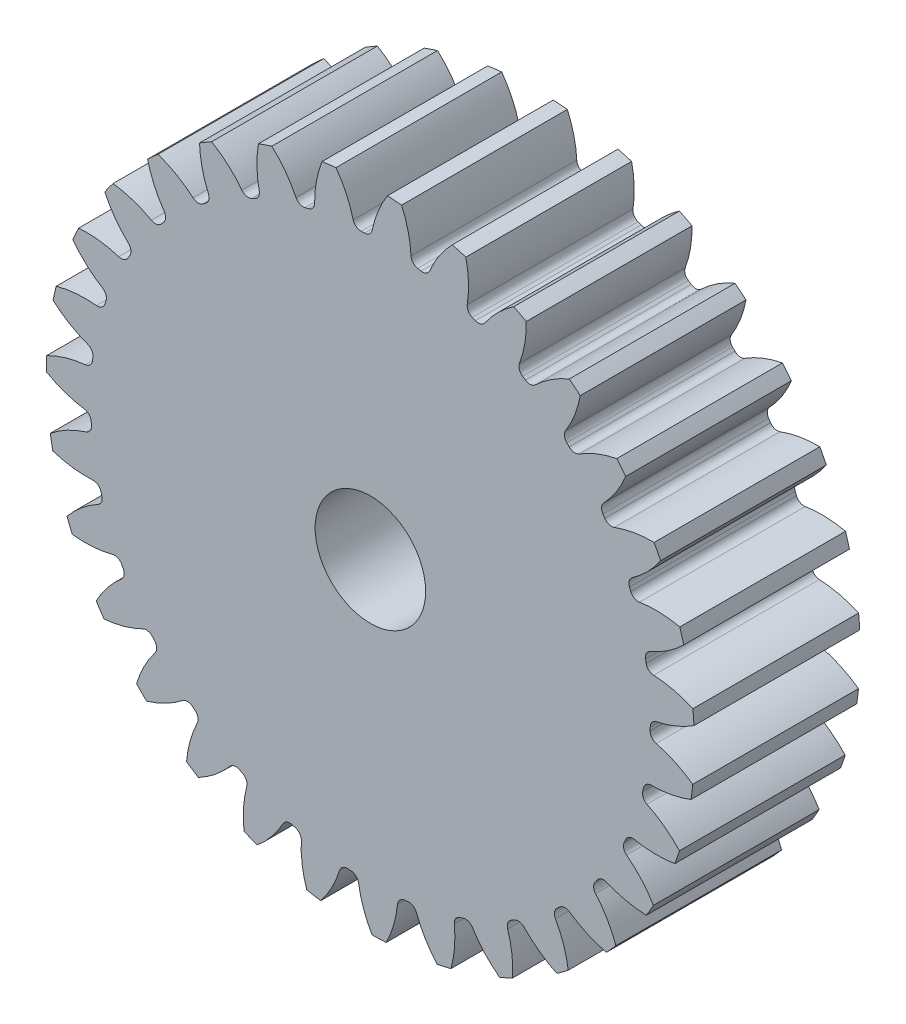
from build123d import *

# Parameters (mm, degrees)
SKETCH3_R         = 186.266666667
GEARBODY_DEPTH    = 95.25
TOOTHCUT_DEPTH    = 281.112664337
CIRPATTERN1_COUNT = 31
BOREDIA_R         = 31.75
BORE_DEPTH        = 12700


with BuildPart() as part:
    # Sketch3 → gearBody (new body)
    with BuildSketch(Plane.XY):
        Circle(SKETCH3_R)
    extrude(amount=GEARBODY_DEPTH)

    # Sketch2 → toothCut (cut, through all)
    with BuildSketch(Plane.XY):
        with BuildLine():
            ThreePointArc((160.794464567, -4.819191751), (160.820897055, -3.837123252), (160.841331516, -2.854911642))
            ThreePointArc((160.841331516, -2.854911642), (161.900402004, -0.001243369), (164.510857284, 1.564188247))
            ThreePointArc((164.510857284, 1.564188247), (175.814463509, 5.024444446), (186.266666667, 10.546793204))
            ThreePointArc((186.266666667, 10.546793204), (186.511936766, -4.450101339), (185.551712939, -19.418233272))
            ThreePointArc((185.551712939, -19.418233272), (175.374775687, -13.403681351), (164.249058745, -9.408270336))
            ThreePointArc((164.249058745, -9.408270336), (161.716232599, -7.720122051), (160.794464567, -4.819191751))
        make_face()
    toothcut = extrude(amount=TOOTHCUT_DEPTH, mode=Mode.SUBTRACT)

    # CirPattern1: toothCut ×31 about axis
    cirpattern1_axis = Axis((0, 0, 0), (0, 0, 1))
    for i in range(1, CIRPATTERN1_COUNT):
        add(toothcut.rotate(cirpattern1_axis, i * 360 / CIRPATTERN1_COUNT), mode=Mode.SUBTRACT)

    # boreDia → bore (cut, symmetric)
    with BuildSketch(Plane.XY):
        Circle(BOREDIA_R)
    extrude(amount=BORE_DEPTH, both=True, mode=Mode.SUBTRACT)


solid = part.part
